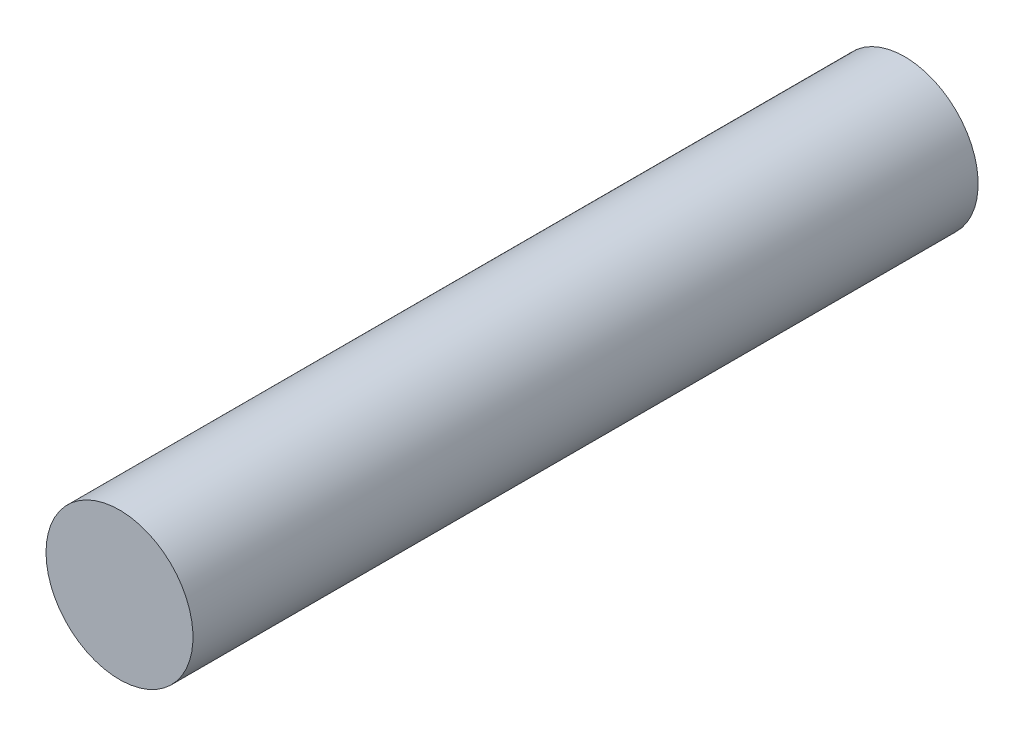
ISO-10303-21;
HEADER;
FILE_DESCRIPTION(('STEP AP214'),'2;1');
FILE_NAME('part.step','',(''),(''),'','','');
FILE_SCHEMA(('AUTOMOTIVE_DESIGN { 1 0 10303 214 1 1 1 1 }'));
ENDSEC;
DATA;
#1=APPLICATION_CONTEXT('core data for automotive mechanical design processes');
#2=APPLICATION_PROTOCOL_DEFINITION('international standard','automotive_design',2000,#1);
#3=PRODUCT_CONTEXT('',#1,'mechanical');
#4=PRODUCT('Part','Part','',(#3));
#5=PRODUCT_RELATED_PRODUCT_CATEGORY('part','',(#4));
#6=PRODUCT_DEFINITION_FORMATION('','',#4);
#7=PRODUCT_DEFINITION_CONTEXT('part definition',#1,'design');
#8=PRODUCT_DEFINITION('design','',#6,#7);
#9=PRODUCT_DEFINITION_SHAPE('','',#8);
#10=(LENGTH_UNIT() NAMED_UNIT(*) SI_UNIT(.MILLI.,.METRE.));
#11=(NAMED_UNIT(*) PLANE_ANGLE_UNIT() SI_UNIT($,.RADIAN.));
#12=(NAMED_UNIT(*) SI_UNIT($,.STERADIAN.) SOLID_ANGLE_UNIT());
#13=UNCERTAINTY_MEASURE_WITH_UNIT(LENGTH_MEASURE(1.E-05),#10,'distance_accuracy_value','');
#14=(GEOMETRIC_REPRESENTATION_CONTEXT(3) GLOBAL_UNCERTAINTY_ASSIGNED_CONTEXT((#13)) GLOBAL_UNIT_ASSIGNED_CONTEXT((#10,
#11,#12)) REPRESENTATION_CONTEXT('',''));
#15=CARTESIAN_POINT('',(0.,0.,0.));
#16=DIRECTION('',(0.,0.,1.));
#17=DIRECTION('',(1.,0.,0.));
#18=AXIS2_PLACEMENT_3D('',#15,#16,#17);
#19=CARTESIAN_POINT('',(0.,0.,203.));
#20=DIRECTION('',(0.,0.,-1.));
#21=DIRECTION('',(-1.,0.,0.));
#22=AXIS2_PLACEMENT_3D('',#19,#20,#21);
#23=CYLINDRICAL_SURFACE('',#22,38.);
#24=CARTESIAN_POINT('',(0.,0.,203.));
#25=DIRECTION('',(0.,0.,1.));
#26=DIRECTION('',(1.,0.,0.));
#27=AXIS2_PLACEMENT_3D('',#24,#25,#26);
#28=CIRCLE('',#27,38.);
#29=CARTESIAN_POINT('',(-38.,0.,203.));
#30=VERTEX_POINT('',#29);
#31=EDGE_CURVE('E10',#30,#30,#28,.T.);
#32=CARTESIAN_POINT('',(0.,0.,-203.));
#33=DIRECTION('',(0.,0.,1.));
#34=DIRECTION('',(1.,0.,0.));
#35=AXIS2_PLACEMENT_3D('',#32,#33,#34);
#36=CIRCLE('',#35,38.);
#37=CARTESIAN_POINT('',(-38.,0.,-203.));
#38=VERTEX_POINT('',#37);
#39=EDGE_CURVE('E34',#38,#38,#36,.T.);
#40=CARTESIAN_POINT('',(-38.,0.,203.));
#41=CARTESIAN_POINT('',(-38.,0.,198.770833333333));
#42=CARTESIAN_POINT('',(-38.,0.,194.541666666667));
#43=CARTESIAN_POINT('',(-38.,0.,186.083333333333));
#44=CARTESIAN_POINT('',(-38.,0.,181.854166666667));
#45=CARTESIAN_POINT('',(-38.,0.,173.395833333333));
#46=CARTESIAN_POINT('',(-38.,0.,169.166666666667));
#47=CARTESIAN_POINT('',(-38.,0.,160.708333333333));
#48=CARTESIAN_POINT('',(-38.,0.,156.479166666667));
#49=CARTESIAN_POINT('',(-38.,0.,148.020833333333));
#50=CARTESIAN_POINT('',(-38.,0.,143.791666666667));
#51=CARTESIAN_POINT('',(-38.,0.,135.333333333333));
#52=CARTESIAN_POINT('',(-38.,0.,131.104166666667));
#53=CARTESIAN_POINT('',(-38.,0.,122.645833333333));
#54=CARTESIAN_POINT('',(-38.,0.,118.416666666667));
#55=CARTESIAN_POINT('',(-38.,0.,109.958333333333));
#56=CARTESIAN_POINT('',(-38.,0.,105.729166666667));
#57=CARTESIAN_POINT('',(-38.,0.,97.2708333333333));
#58=CARTESIAN_POINT('',(-38.,0.,93.0416666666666));
#59=CARTESIAN_POINT('',(-38.,0.,84.5833333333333));
#60=CARTESIAN_POINT('',(-38.,0.,80.3541666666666));
#61=CARTESIAN_POINT('',(-38.,0.,71.8958333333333));
#62=CARTESIAN_POINT('',(-38.,0.,67.6666666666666));
#63=CARTESIAN_POINT('',(-38.,0.,59.2083333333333));
#64=CARTESIAN_POINT('',(-38.,0.,54.9791666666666));
#65=CARTESIAN_POINT('',(-38.,0.,46.5208333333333));
#66=CARTESIAN_POINT('',(-38.,0.,42.2916666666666));
#67=CARTESIAN_POINT('',(-38.,0.,33.8333333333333));
#68=CARTESIAN_POINT('',(-38.,0.,29.6041666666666));
#69=CARTESIAN_POINT('',(-38.,0.,21.1458333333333));
#70=CARTESIAN_POINT('',(-38.,0.,16.9166666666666));
#71=CARTESIAN_POINT('',(-38.,0.,8.45833333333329));
#72=CARTESIAN_POINT('',(-38.,0.,4.22916666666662));
#73=CARTESIAN_POINT('',(-38.,0.,-4.22916666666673));
#74=CARTESIAN_POINT('',(-38.,0.,-8.4583333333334));
#75=CARTESIAN_POINT('',(-38.,0.,-16.9166666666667));
#76=CARTESIAN_POINT('',(-38.,0.,-21.1458333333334));
#77=CARTESIAN_POINT('',(-38.,0.,-29.6041666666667));
#78=CARTESIAN_POINT('',(-38.,0.,-33.8333333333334));
#79=CARTESIAN_POINT('',(-38.,0.,-42.2916666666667));
#80=CARTESIAN_POINT('',(-38.,0.,-46.5208333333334));
#81=CARTESIAN_POINT('',(-38.,0.,-54.9791666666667));
#82=CARTESIAN_POINT('',(-38.,0.,-59.2083333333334));
#83=CARTESIAN_POINT('',(-38.,0.,-67.6666666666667));
#84=CARTESIAN_POINT('',(-38.,0.,-71.8958333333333));
#85=CARTESIAN_POINT('',(-38.,0.,-80.3541666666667));
#86=CARTESIAN_POINT('',(-38.,0.,-84.5833333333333));
#87=CARTESIAN_POINT('',(-38.,0.,-93.0416666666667));
#88=CARTESIAN_POINT('',(-38.,0.,-97.2708333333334));
#89=CARTESIAN_POINT('',(-38.,0.,-105.729166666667));
#90=CARTESIAN_POINT('',(-38.,0.,-109.958333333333));
#91=CARTESIAN_POINT('',(-38.,0.,-118.416666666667));
#92=CARTESIAN_POINT('',(-38.,0.,-122.645833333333));
#93=CARTESIAN_POINT('',(-38.,0.,-131.104166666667));
#94=CARTESIAN_POINT('',(-38.,0.,-135.333333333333));
#95=CARTESIAN_POINT('',(-38.,0.,-143.791666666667));
#96=CARTESIAN_POINT('',(-38.,0.,-148.020833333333));
#97=CARTESIAN_POINT('',(-38.,0.,-156.479166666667));
#98=CARTESIAN_POINT('',(-38.,0.,-160.708333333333));
#99=CARTESIAN_POINT('',(-38.,0.,-169.166666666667));
#100=CARTESIAN_POINT('',(-38.,0.,-173.395833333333));
#101=CARTESIAN_POINT('',(-38.,0.,-181.854166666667));
#102=CARTESIAN_POINT('',(-38.,0.,-186.083333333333));
#103=CARTESIAN_POINT('',(-38.,0.,-194.541666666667));
#104=CARTESIAN_POINT('',(-38.,0.,-198.770833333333));
#105=CARTESIAN_POINT('',(-38.,0.,-203.));
#106=B_SPLINE_CURVE_WITH_KNOTS('',3,(#40,#41,#42,#43,#44,#45,#46,#47,#48,#49,#50,#51,#52,#53,
#54,#55,#56,#57,#58,#59,#60,#61,#62,#63,#64,#65,#66,#67,#68,#69,#70,#71,#72,#73,#74,#75,#76,#77,
#78,#79,#80,#81,#82,#83,#84,#85,#86,#87,#88,#89,#90,#91,#92,#93,#94,#95,#96,#97,#98,#99,#100,
#101,#102,#103,#104,#105),.UNSPECIFIED.,.F.,.F.,(4,2,2,2,2,2,2,2,2,2,2,2,2,2,2,2,2,2,2,2,2,2,2,
2,2,2,2,2,2,2,2,2,4),(0.,12.6875,25.375,38.0625,50.75,63.4375,76.125,88.8125,101.5,114.1875,
126.875,139.5625,152.25,164.9375,177.625,190.3125,203.,215.6875,228.375,241.0625,253.75,
266.4375,279.125,291.8125,304.5,317.1875,329.875,342.5625,355.25,367.9375,380.625,393.3125,
406.),.UNSPECIFIED.);
#107=EDGE_CURVE('BSEAM31',#30,#38,#106,.T.);
#108=ORIENTED_EDGE('',*,*,#31,.F.);
#109=ORIENTED_EDGE('',*,*,#39,.T.);
#110=ORIENTED_EDGE('',*,*,#107,.T.);
#111=ORIENTED_EDGE('',*,*,#107,.F.);
#112=EDGE_LOOP('',(#108,#110,#109,#111));
#113=FACE_BOUND('',#112,.T.);
#114=ADVANCED_FACE('F31',(#113),#23,.T.);
#115=CARTESIAN_POINT('',(0.,0.,203.));
#116=DIRECTION('',(0.,0.,1.));
#117=DIRECTION('',(1.,0.,0.));
#118=AXIS2_PLACEMENT_3D('',#115,#116,#117);
#119=PLANE('',#118);
#120=ORIENTED_EDGE('',*,*,#31,.T.);
#121=EDGE_LOOP('',(#120));
#122=FACE_BOUND('',#121,.T.);
#123=ADVANCED_FACE('F46',(#122),#119,.T.);
#124=CARTESIAN_POINT('',(0.,0.,-203.));
#125=DIRECTION('',(0.,0.,1.));
#126=DIRECTION('',(1.,0.,0.));
#127=AXIS2_PLACEMENT_3D('',#124,#125,#126);
#128=PLANE('',#127);
#129=ORIENTED_EDGE('',*,*,#39,.F.);
#130=EDGE_LOOP('',(#129));
#131=FACE_BOUND('',#130,.T.);
#132=ADVANCED_FACE('F44',(#131),#128,.F.);
#133=CLOSED_SHELL('',(#114,#123,#132));
#134=MANIFOLD_SOLID_BREP('B2',#133);
#135=ADVANCED_BREP_SHAPE_REPRESENTATION('',(#18,#134),#14);
#136=SHAPE_DEFINITION_REPRESENTATION(#9,#135);
ENDSEC;
END-ISO-10303-21;
